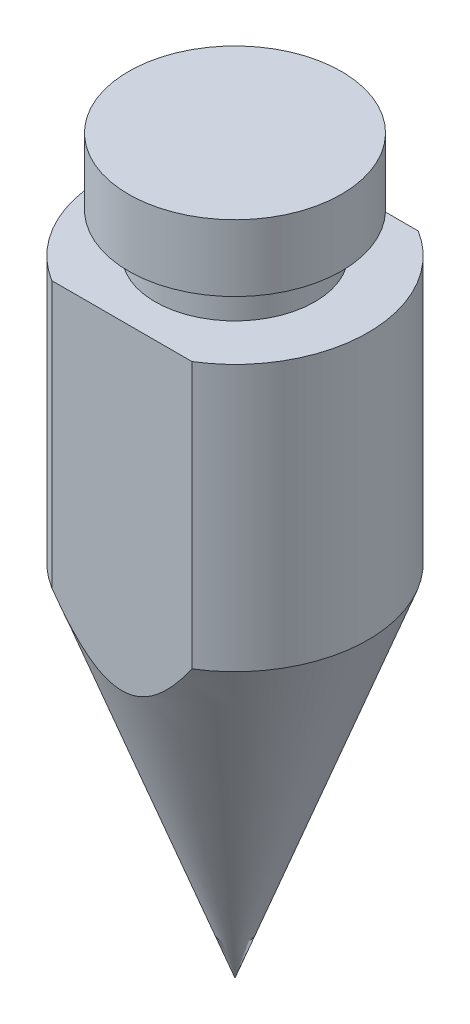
from build123d import *

# Parameters (mm, degrees)
SKETCH_2_W          = 10.535653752
SKETCH_2_H          = 10
CUT_EXTRUDE_1_DEPTH = 50.081564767


with BuildPart() as part:
    # Sketch 1 → Revolve 1 (revolve)
    with BuildSketch(Plane.XY, mode=Mode.PRIVATE) as revolve_1_sk:
        Polygon((0, 0), (0, -27), (-10, 0), (-10, 20), (-6, 20), (-6, 23), (-8, 23), (-8, 28), (0, 28), align=None)
    revolve(revolve_1_sk.sketch.rotate(Axis((0, 0, 0), (0, 1, 0)), 180), axis=Axis((0, 0, 0), (0, 1, 0)))

    # Sketch 2 → Cut-Extrude 1 (cut, through all)
    with BuildSketch(Plane(origin=(0, 20, 0), x_dir=(1, 0, 0), z_dir=(0, 1, 0))):
        with Locations((0, 13.5)):
            Rectangle(SKETCH_2_W, SKETCH_2_H)
        with Locations((0, -13.5)):
            Rectangle(SKETCH_2_W, SKETCH_2_H)
    extrude(amount=-CUT_EXTRUDE_1_DEPTH, mode=Mode.SUBTRACT)


solid = part.part
